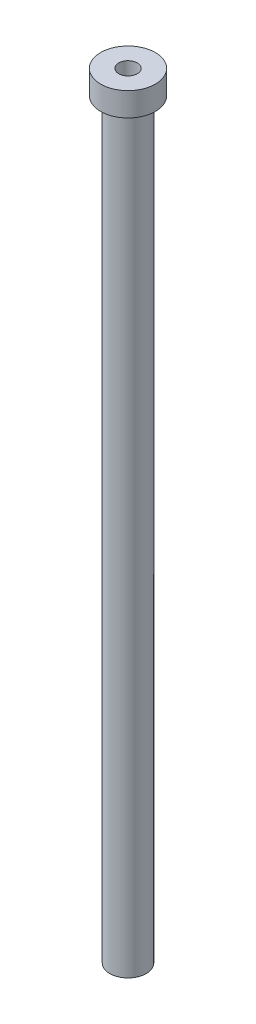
ISO-10303-21;
HEADER;
FILE_DESCRIPTION(('STEP AP214'),'2;1');
FILE_NAME('part.step','',(''),(''),'','','');
FILE_SCHEMA(('AUTOMOTIVE_DESIGN { 1 0 10303 214 1 1 1 1 }'));
ENDSEC;
DATA;
#1=APPLICATION_CONTEXT('core data for automotive mechanical design processes');
#2=APPLICATION_PROTOCOL_DEFINITION('international standard','automotive_design',2000,#1);
#3=PRODUCT_CONTEXT('',#1,'mechanical');
#4=PRODUCT('Part','Part','',(#3));
#5=PRODUCT_RELATED_PRODUCT_CATEGORY('part','',(#4));
#6=PRODUCT_DEFINITION_FORMATION('','',#4);
#7=PRODUCT_DEFINITION_CONTEXT('part definition',#1,'design');
#8=PRODUCT_DEFINITION('design','',#6,#7);
#9=PRODUCT_DEFINITION_SHAPE('','',#8);
#10=(LENGTH_UNIT() NAMED_UNIT(*) SI_UNIT(.MILLI.,.METRE.));
#11=(NAMED_UNIT(*) PLANE_ANGLE_UNIT() SI_UNIT($,.RADIAN.));
#12=(NAMED_UNIT(*) SI_UNIT($,.STERADIAN.) SOLID_ANGLE_UNIT());
#13=UNCERTAINTY_MEASURE_WITH_UNIT(LENGTH_MEASURE(1.E-05),#10,'distance_accuracy_value','');
#14=(GEOMETRIC_REPRESENTATION_CONTEXT(3) GLOBAL_UNCERTAINTY_ASSIGNED_CONTEXT((#13)) GLOBAL_UNIT_ASSIGNED_CONTEXT((#10,
#11,#12)) REPRESENTATION_CONTEXT('',''));
#15=CARTESIAN_POINT('',(0.,0.,0.));
#16=DIRECTION('',(0.,0.,1.));
#17=DIRECTION('',(1.,0.,0.));
#18=AXIS2_PLACEMENT_3D('',#15,#16,#17);
#19=CARTESIAN_POINT('',(0.,-91.5234121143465,0.));
#20=DIRECTION('',(0.,-1.,0.));
#21=DIRECTION('',(0.,0.,-1.));
#22=AXIS2_PLACEMENT_3D('',#19,#20,#21);
#23=CYLINDRICAL_SURFACE('',#22,3.);
#24=CARTESIAN_POINT('',(0.,-2.6,0.));
#25=DIRECTION('',(0.,-1.,0.));
#26=DIRECTION('',(0.,0.,-1.));
#27=AXIS2_PLACEMENT_3D('',#24,#25,#26);
#28=CIRCLE('',#27,3.);
#29=CARTESIAN_POINT('',(0.,-2.6,-3.));
#30=VERTEX_POINT('',#29);
#31=EDGE_CURVE('E11',#30,#30,#28,.T.);
#32=ORIENTED_EDGE('',*,*,#31,.F.);
#33=EDGE_LOOP('',(#32));
#34=FACE_BOUND('',#33,.T.);
#35=CARTESIAN_POINT('',(0.,0.,0.));
#36=DIRECTION('',(0.,-1.,0.));
#37=DIRECTION('',(0.,0.,-1.));
#38=AXIS2_PLACEMENT_3D('',#35,#36,#37);
#39=CIRCLE('',#38,3.);
#40=CARTESIAN_POINT('',(0.,0.,-3.));
#41=VERTEX_POINT('',#40);
#42=EDGE_CURVE('E68',#41,#41,#39,.T.);
#43=ORIENTED_EDGE('',*,*,#42,.T.);
#44=EDGE_LOOP('',(#43));
#45=FACE_BOUND('',#44,.T.);
#46=ADVANCED_FACE('F34',(#34,#45),#23,.T.);
#47=CARTESIAN_POINT('',(0.,-2.6,3.));
#48=DIRECTION('',(0.,1.,0.));
#49=DIRECTION('',(0.,0.,1.));
#50=AXIS2_PLACEMENT_3D('',#47,#48,#49);
#51=PLANE('',#50);
#52=CARTESIAN_POINT('',(0.,-2.6,0.));
#53=DIRECTION('',(0.,-1.,0.));
#54=DIRECTION('',(0.,0.,-1.));
#55=AXIS2_PLACEMENT_3D('',#52,#53,#54);
#56=CIRCLE('',#55,2.);
#57=CARTESIAN_POINT('',(0.,-2.6,-2.));
#58=VERTEX_POINT('',#57);
#59=EDGE_CURVE('E41',#58,#58,#56,.T.);
#60=ORIENTED_EDGE('',*,*,#59,.F.);
#61=EDGE_LOOP('',(#60));
#62=FACE_BOUND('',#61,.T.);
#63=ORIENTED_EDGE('',*,*,#31,.T.);
#64=EDGE_LOOP('',(#63));
#65=FACE_BOUND('',#64,.T.);
#66=ADVANCED_FACE('F78',(#62,#65),#51,.F.);
#67=CARTESIAN_POINT('',(0.,-91.5234121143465,0.));
#68=DIRECTION('',(0.,-1.,0.));
#69=DIRECTION('',(0.,0.,-1.));
#70=AXIS2_PLACEMENT_3D('',#67,#68,#69);
#71=CYLINDRICAL_SURFACE('',#70,1.99999999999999);
#72=CARTESIAN_POINT('',(0.,-85.,0.));
#73=DIRECTION('',(0.,-1.,0.));
#74=DIRECTION('',(0.,0.,-1.));
#75=AXIS2_PLACEMENT_3D('',#72,#73,#74);
#76=CIRCLE('',#75,1.99999999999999);
#77=CARTESIAN_POINT('',(0.,-85.,-1.99999999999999));
#78=VERTEX_POINT('',#77);
#79=EDGE_CURVE('E71',#78,#78,#76,.T.);
#80=ORIENTED_EDGE('',*,*,#79,.F.);
#81=EDGE_LOOP('',(#80));
#82=FACE_BOUND('',#81,.T.);
#83=ORIENTED_EDGE('',*,*,#59,.T.);
#84=EDGE_LOOP('',(#83));
#85=FACE_BOUND('',#84,.T.);
#86=ADVANCED_FACE('F76',(#82,#85),#71,.T.);
#87=CARTESIAN_POINT('',(0.,-85.,1.99999999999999));
#88=DIRECTION('',(0.,1.,0.));
#89=DIRECTION('',(0.,0.,1.));
#90=AXIS2_PLACEMENT_3D('',#87,#88,#89);
#91=PLANE('',#90);
#92=CARTESIAN_POINT('',(0.,-85.,0.));
#93=DIRECTION('',(0.,-1.,0.));
#94=DIRECTION('',(0.,0.,-1.));
#95=AXIS2_PLACEMENT_3D('',#92,#93,#94);
#96=CIRCLE('',#95,1.02499999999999);
#97=CARTESIAN_POINT('',(0.,-85.,-1.02499999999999));
#98=VERTEX_POINT('',#97);
#99=EDGE_CURVE('E57',#98,#98,#96,.T.);
#100=ORIENTED_EDGE('',*,*,#99,.F.);
#101=EDGE_LOOP('',(#100));
#102=FACE_BOUND('',#101,.T.);
#103=ORIENTED_EDGE('',*,*,#79,.T.);
#104=EDGE_LOOP('',(#103));
#105=FACE_BOUND('',#104,.T.);
#106=ADVANCED_FACE('F90',(#102,#105),#91,.F.);
#107=CARTESIAN_POINT('',(0.,0.,3.));
#108=DIRECTION('',(0.,-1.,0.));
#109=DIRECTION('',(0.,0.,-1.));
#110=AXIS2_PLACEMENT_3D('',#107,#108,#109);
#111=PLANE('',#110);
#112=CARTESIAN_POINT('',(0.,0.,0.));
#113=DIRECTION('',(0.,1.,0.));
#114=DIRECTION('',(0.,0.,1.));
#115=AXIS2_PLACEMENT_3D('',#112,#113,#114);
#116=CIRCLE('',#115,1.02499999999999);
#117=CARTESIAN_POINT('',(0.,0.,1.02499999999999));
#118=VERTEX_POINT('',#117);
#119=EDGE_CURVE('E58',#118,#118,#116,.T.);
#120=ORIENTED_EDGE('',*,*,#119,.F.);
#121=EDGE_LOOP('',(#120));
#122=FACE_BOUND('',#121,.T.);
#123=ORIENTED_EDGE('',*,*,#42,.F.);
#124=EDGE_LOOP('',(#123));
#125=FACE_BOUND('',#124,.T.);
#126=ADVANCED_FACE('F87',(#122,#125),#111,.F.);
#127=CARTESIAN_POINT('',(0.,-77.75,0.));
#128=DIRECTION('',(0.,-1.,0.));
#129=DIRECTION('',(0.,0.,-1.));
#130=AXIS2_PLACEMENT_3D('',#127,#128,#129);
#131=CONICAL_SURFACE('',#130,1.02499999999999,1.02974425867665);
#132=CARTESIAN_POINT('',(0.,-77.1341178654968,0.));
#133=VERTEX_POINT('',#132);
#134=VERTEX_LOOP('',#133);
#135=FACE_BOUND('',#134,.T.);
#136=CARTESIAN_POINT('',(0.,-77.75,0.));
#137=DIRECTION('',(0.,-1.,0.));
#138=DIRECTION('',(0.,0.,-1.));
#139=AXIS2_PLACEMENT_3D('',#136,#137,#138);
#140=CIRCLE('',#139,1.02499999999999);
#141=CARTESIAN_POINT('',(0.,-77.75,-1.02499999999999));
#142=VERTEX_POINT('',#141);
#143=EDGE_CURVE('E61',#142,#142,#140,.T.);
#144=ORIENTED_EDGE('',*,*,#143,.T.);
#145=EDGE_LOOP('',(#144));
#146=FACE_BOUND('',#145,.T.);
#147=ADVANCED_FACE('F89',(#135,#146),#131,.F.);
#148=CARTESIAN_POINT('',(0.,-85.,0.));
#149=DIRECTION('',(0.,-1.,0.));
#150=DIRECTION('',(0.,0.,-1.));
#151=AXIS2_PLACEMENT_3D('',#148,#149,#150);
#152=CYLINDRICAL_SURFACE('',#151,1.02499999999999);
#153=ORIENTED_EDGE('',*,*,#143,.F.);
#154=EDGE_LOOP('',(#153));
#155=FACE_BOUND('',#154,.T.);
#156=ORIENTED_EDGE('',*,*,#99,.T.);
#157=EDGE_LOOP('',(#156));
#158=FACE_BOUND('',#157,.T.);
#159=ADVANCED_FACE('F51',(#155,#158),#152,.F.);
#160=CARTESIAN_POINT('',(0.,-7.25000000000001,0.));
#161=DIRECTION('',(0.,1.,0.));
#162=DIRECTION('',(0.,0.,1.));
#163=AXIS2_PLACEMENT_3D('',#160,#161,#162);
#164=CONICAL_SURFACE('',#163,1.02499999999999,1.02974425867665);
#165=CARTESIAN_POINT('',(0.,-7.86588213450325,0.));
#166=VERTEX_POINT('',#165);
#167=VERTEX_LOOP('',#166);
#168=FACE_BOUND('',#167,.T.);
#169=CARTESIAN_POINT('',(0.,-7.25000000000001,0.));
#170=DIRECTION('',(0.,1.,0.));
#171=DIRECTION('',(0.,0.,1.));
#172=AXIS2_PLACEMENT_3D('',#169,#170,#171);
#173=CIRCLE('',#172,1.02499999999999);
#174=CARTESIAN_POINT('',(0.,-7.25000000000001,1.02499999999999));
#175=VERTEX_POINT('',#174);
#176=EDGE_CURVE('E55',#175,#175,#173,.T.);
#177=ORIENTED_EDGE('',*,*,#176,.T.);
#178=EDGE_LOOP('',(#177));
#179=FACE_BOUND('',#178,.T.);
#180=ADVANCED_FACE('F47',(#168,#179),#164,.F.);
#181=CARTESIAN_POINT('',(0.,0.,0.));
#182=DIRECTION('',(0.,1.,0.));
#183=DIRECTION('',(0.,0.,1.));
#184=AXIS2_PLACEMENT_3D('',#181,#182,#183);
#185=CYLINDRICAL_SURFACE('',#184,1.02499999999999);
#186=ORIENTED_EDGE('',*,*,#176,.F.);
#187=EDGE_LOOP('',(#186));
#188=FACE_BOUND('',#187,.T.);
#189=ORIENTED_EDGE('',*,*,#119,.T.);
#190=EDGE_LOOP('',(#189));
#191=FACE_BOUND('',#190,.T.);
#192=ADVANCED_FACE('F50',(#188,#191),#185,.F.);
#193=CLOSED_SHELL('',(#46,#66,#86,#106,#126,#147,#159,#180,#192));
#194=MANIFOLD_SOLID_BREP('B2',#193);
#195=ADVANCED_BREP_SHAPE_REPRESENTATION('',(#18,#194),#14);
#196=SHAPE_DEFINITION_REPRESENTATION(#9,#195);
ENDSEC;
END-ISO-10303-21;
